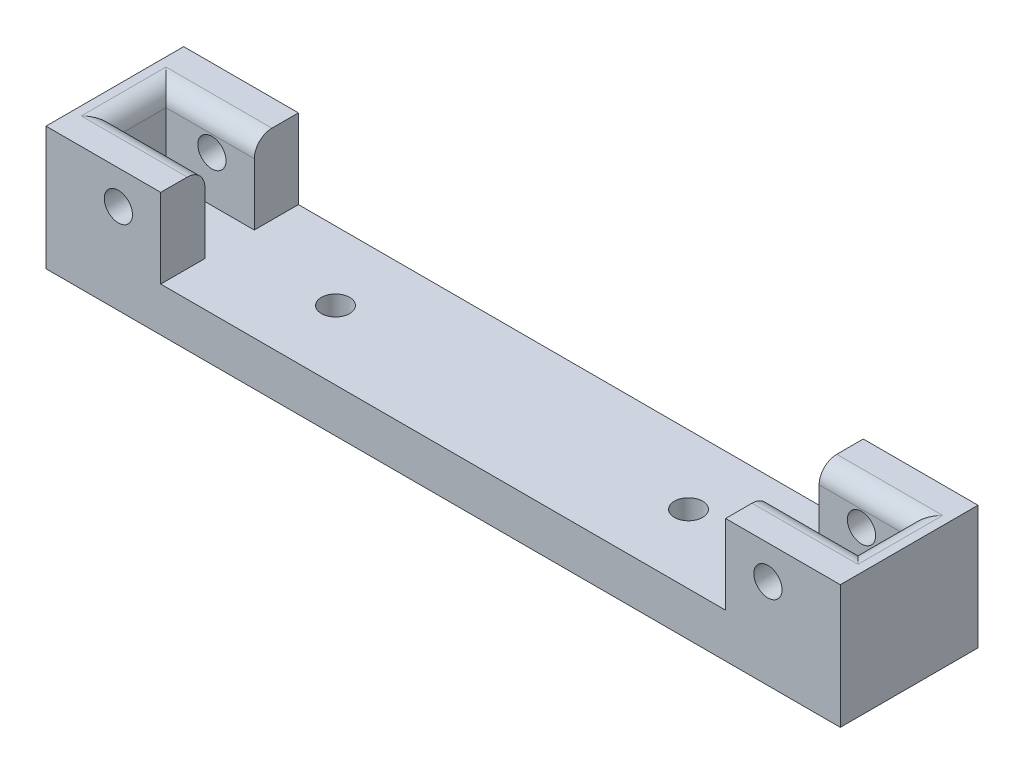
ISO-10303-21;
HEADER;
FILE_DESCRIPTION(('STEP AP214'),'2;1');
FILE_NAME('part.step','',(''),(''),'','','');
FILE_SCHEMA(('AUTOMOTIVE_DESIGN { 1 0 10303 214 1 1 1 1 }'));
ENDSEC;
DATA;
#1=APPLICATION_CONTEXT('core data for automotive mechanical design processes');
#2=APPLICATION_PROTOCOL_DEFINITION('international standard','automotive_design',2000,#1);
#3=PRODUCT_CONTEXT('',#1,'mechanical');
#4=PRODUCT('Part','Part','',(#3));
#5=PRODUCT_RELATED_PRODUCT_CATEGORY('part','',(#4));
#6=PRODUCT_DEFINITION_FORMATION('','',#4);
#7=PRODUCT_DEFINITION_CONTEXT('part definition',#1,'design');
#8=PRODUCT_DEFINITION('design','',#6,#7);
#9=PRODUCT_DEFINITION_SHAPE('','',#8);
#10=(LENGTH_UNIT() NAMED_UNIT(*) SI_UNIT(.MILLI.,.METRE.));
#11=(NAMED_UNIT(*) PLANE_ANGLE_UNIT() SI_UNIT($,.RADIAN.));
#12=(NAMED_UNIT(*) SI_UNIT($,.STERADIAN.) SOLID_ANGLE_UNIT());
#13=UNCERTAINTY_MEASURE_WITH_UNIT(LENGTH_MEASURE(1.E-05),#10,'distance_accuracy_value','');
#14=(GEOMETRIC_REPRESENTATION_CONTEXT(3) GLOBAL_UNCERTAINTY_ASSIGNED_CONTEXT((#13)) GLOBAL_UNIT_ASSIGNED_CONTEXT((#10,
#11,#12)) REPRESENTATION_CONTEXT('',''));
#15=CARTESIAN_POINT('',(0.,0.,0.));
#16=DIRECTION('',(0.,0.,1.));
#17=DIRECTION('',(1.,0.,0.));
#18=AXIS2_PLACEMENT_3D('',#15,#16,#17);
#19=CARTESIAN_POINT('',(0.,6.35,0.));
#20=DIRECTION('',(0.,-1.,0.));
#21=DIRECTION('',(0.,0.,-1.));
#22=AXIS2_PLACEMENT_3D('',#19,#20,#21);
#23=PLANE('',#22);
#24=CARTESIAN_POINT('',(82.55,6.35,-9.906));
#25=DIRECTION('',(0.,-1.,0.));
#26=DIRECTION('',(0.,0.,1.));
#27=AXIS2_PLACEMENT_3D('',#24,#25,#26);
#28=CIRCLE('',#27,2.032);
#29=CARTESIAN_POINT('',(82.55,6.35,-7.874));
#30=VERTEX_POINT('',#29);
#31=EDGE_CURVE('E395',#30,#30,#28,.T.);
#32=ORIENTED_EDGE('',*,*,#31,.T.);
#33=EDGE_LOOP('',(#32));
#34=FACE_BOUND('',#33,.T.);
#35=CARTESIAN_POINT('',(31.75,6.35,-9.906));
#36=DIRECTION('',(0.,1.,0.));
#37=DIRECTION('',(0.,0.,1.));
#38=AXIS2_PLACEMENT_3D('',#35,#36,#37);
#39=CIRCLE('',#38,2.032);
#40=CARTESIAN_POINT('',(31.75,6.35,-7.874));
#41=VERTEX_POINT('',#40);
#42=EDGE_CURVE('E388',#41,#41,#39,.T.);
#43=ORIENTED_EDGE('',*,*,#42,.F.);
#44=EDGE_LOOP('',(#43));
#45=FACE_BOUND('',#44,.T.);
#46=DIRECTION('',(-1.,0.,0.));
#47=VECTOR('',#46,1.);
#48=CARTESIAN_POINT('',(110.49,6.35,-13.462));
#49=LINE('',#48,#47);
#50=CARTESIAN_POINT('',(110.49,6.35,-13.462));
#51=VERTEX_POINT('',#50);
#52=CARTESIAN_POINT('',(97.79,6.35,-13.462));
#53=VERTEX_POINT('',#52);
#54=EDGE_CURVE('E182',#51,#53,#49,.T.);
#55=ORIENTED_EDGE('',*,*,#54,.T.);
#56=DIRECTION('',(0.,0.,-1.));
#57=VECTOR('',#56,1.);
#58=CARTESIAN_POINT('',(97.79,6.35,-19.812));
#59=LINE('',#58,#57);
#60=CARTESIAN_POINT('',(97.79,6.35,-19.812));
#61=VERTEX_POINT('',#60);
#62=EDGE_CURVE('E405',#53,#61,#59,.T.);
#63=ORIENTED_EDGE('',*,*,#62,.T.);
#64=DIRECTION('',(-1.,0.,0.));
#65=VECTOR('',#64,1.);
#66=CARTESIAN_POINT('',(0.,6.35,-19.812));
#67=LINE('',#66,#65);
#68=CARTESIAN_POINT('',(16.51,6.35,-19.812));
#69=VERTEX_POINT('',#68);
#70=EDGE_CURVE('E200',#61,#69,#67,.T.);
#71=ORIENTED_EDGE('',*,*,#70,.T.);
#72=DIRECTION('',(0.,0.,-1.));
#73=VECTOR('',#72,1.);
#74=CARTESIAN_POINT('',(16.51,6.35,-19.812));
#75=LINE('',#74,#73);
#76=CARTESIAN_POINT('',(16.51,6.35,-13.462));
#77=VERTEX_POINT('',#76);
#78=EDGE_CURVE('E241',#77,#69,#75,.T.);
#79=ORIENTED_EDGE('',*,*,#78,.F.);
#80=DIRECTION('',(1.,0.,0.));
#81=VECTOR('',#80,1.);
#82=CARTESIAN_POINT('',(3.81,6.35,-13.462));
#83=LINE('',#82,#81);
#84=CARTESIAN_POINT('',(3.81,6.35,-13.462));
#85=VERTEX_POINT('',#84);
#86=EDGE_CURVE('E237',#85,#77,#83,.T.);
#87=ORIENTED_EDGE('',*,*,#86,.F.);
#88=DIRECTION('',(0.,0.,-1.));
#89=VECTOR('',#88,1.);
#90=CARTESIAN_POINT('',(3.81,6.35,-19.812));
#91=LINE('',#90,#89);
#92=CARTESIAN_POINT('',(3.81,6.35,-6.35));
#93=VERTEX_POINT('',#92);
#94=EDGE_CURVE('E266',#93,#85,#91,.T.);
#95=ORIENTED_EDGE('',*,*,#94,.F.);
#96=DIRECTION('',(-1.,0.,0.));
#97=VECTOR('',#96,1.);
#98=CARTESIAN_POINT('',(3.81,6.35,-6.35));
#99=LINE('',#98,#97);
#100=CARTESIAN_POINT('',(16.51,6.35,-6.35));
#101=VERTEX_POINT('',#100);
#102=EDGE_CURVE('E256',#101,#93,#99,.T.);
#103=ORIENTED_EDGE('',*,*,#102,.F.);
#104=DIRECTION('',(0.,0.,-1.));
#105=VECTOR('',#104,1.);
#106=CARTESIAN_POINT('',(16.51,6.35,0.));
#107=LINE('',#106,#105);
#108=CARTESIAN_POINT('',(16.51,6.35,0.));
#109=VERTEX_POINT('',#108);
#110=EDGE_CURVE('E251',#109,#101,#107,.T.);
#111=ORIENTED_EDGE('',*,*,#110,.F.);
#112=DIRECTION('',(1.,0.,0.));
#113=VECTOR('',#112,1.);
#114=CARTESIAN_POINT('',(0.,6.35,0.));
#115=LINE('',#114,#113);
#116=CARTESIAN_POINT('',(97.79,6.35,0.));
#117=VERTEX_POINT('',#116);
#118=EDGE_CURVE('E286',#109,#117,#115,.T.);
#119=ORIENTED_EDGE('',*,*,#118,.T.);
#120=DIRECTION('',(0.,0.,-1.));
#121=VECTOR('',#120,1.);
#122=CARTESIAN_POINT('',(97.79,6.35,0.));
#123=LINE('',#122,#121);
#124=CARTESIAN_POINT('',(97.79,6.35,-6.35));
#125=VERTEX_POINT('',#124);
#126=EDGE_CURVE('E205',#117,#125,#123,.T.);
#127=ORIENTED_EDGE('',*,*,#126,.T.);
#128=DIRECTION('',(1.,0.,0.));
#129=VECTOR('',#128,1.);
#130=CARTESIAN_POINT('',(110.49,6.35,-6.35));
#131=LINE('',#130,#129);
#132=CARTESIAN_POINT('',(110.49,6.35,-6.35));
#133=VERTEX_POINT('',#132);
#134=EDGE_CURVE('E201',#125,#133,#131,.T.);
#135=ORIENTED_EDGE('',*,*,#134,.T.);
#136=DIRECTION('',(0.,0.,-1.));
#137=VECTOR('',#136,1.);
#138=CARTESIAN_POINT('',(110.49,6.35,-19.812));
#139=LINE('',#138,#137);
#140=EDGE_CURVE('E194',#133,#51,#139,.T.);
#141=ORIENTED_EDGE('',*,*,#140,.T.);
#142=EDGE_LOOP('',(#55,#63,#71,#79,#87,#95,#103,#111,#119,#127,#135,#141));
#143=FACE_BOUND('',#142,.T.);
#144=ADVANCED_FACE('F36',(#34,#45,#143),#23,.F.);
#145=CARTESIAN_POINT('',(3.81,17.78,-19.812));
#146=DIRECTION('',(-1.,0.,0.));
#147=DIRECTION('',(0.,0.,1.));
#148=AXIS2_PLACEMENT_3D('',#145,#146,#147);
#149=PLANE('',#148);
#150=DIRECTION('',(0.,-1.,0.));
#151=VECTOR('',#150,1.);
#152=CARTESIAN_POINT('',(3.81,17.78,-13.462));
#153=LINE('',#152,#151);
#154=CARTESIAN_POINT('',(3.81,15.24,-13.462));
#155=VERTEX_POINT('',#154);
#156=EDGE_CURVE('E249',#155,#85,#153,.T.);
#157=ORIENTED_EDGE('',*,*,#156,.F.);
#158=DIRECTION('',(0.,0.,-1.));
#159=VECTOR('',#158,1.);
#160=CARTESIAN_POINT('',(3.81,15.24,-19.812));
#161=LINE('',#160,#159);
#162=CARTESIAN_POINT('',(3.81,15.24,-6.35));
#163=VERTEX_POINT('',#162);
#164=EDGE_CURVE('E306',#155,#163,#161,.F.);
#165=ORIENTED_EDGE('',*,*,#164,.T.);
#166=DIRECTION('',(0.,-1.,0.));
#167=VECTOR('',#166,1.);
#168=CARTESIAN_POINT('',(3.81,17.78,-6.35));
#169=LINE('',#168,#167);
#170=EDGE_CURVE('E255',#163,#93,#169,.T.);
#171=ORIENTED_EDGE('',*,*,#170,.T.);
#172=ORIENTED_EDGE('',*,*,#94,.T.);
#173=EDGE_LOOP('',(#157,#165,#171,#172));
#174=FACE_BOUND('',#173,.T.);
#175=ADVANCED_FACE('F360',(#174),#149,.F.);
#176=CARTESIAN_POINT('',(0.,6.35,0.));
#177=DIRECTION('',(1.,0.,0.));
#178=DIRECTION('',(0.,0.,-1.));
#179=AXIS2_PLACEMENT_3D('',#176,#177,#178);
#180=PLANE('',#179);
#181=DIRECTION('',(0.,0.,1.));
#182=VECTOR('',#181,1.);
#183=CARTESIAN_POINT('',(0.,0.,0.));
#184=LINE('',#183,#182);
#185=CARTESIAN_POINT('',(0.,0.,-19.812));
#186=VERTEX_POINT('',#185);
#187=CARTESIAN_POINT('',(0.,0.,0.));
#188=VERTEX_POINT('',#187);
#189=EDGE_CURVE('E275',#186,#188,#184,.T.);
#190=ORIENTED_EDGE('',*,*,#189,.T.);
#191=DIRECTION('',(0.,-1.,0.));
#192=VECTOR('',#191,1.);
#193=CARTESIAN_POINT('',(0.,6.35,0.));
#194=LINE('',#193,#192);
#195=CARTESIAN_POINT('',(0.,17.78,0.));
#196=VERTEX_POINT('',#195);
#197=EDGE_CURVE('E284',#196,#188,#194,.T.);
#198=ORIENTED_EDGE('',*,*,#197,.F.);
#199=DIRECTION('',(0.,0.,1.));
#200=VECTOR('',#199,1.);
#201=CARTESIAN_POINT('',(0.,17.78,-19.812));
#202=LINE('',#201,#200);
#203=CARTESIAN_POINT('',(0.,17.78,-19.812));
#204=VERTEX_POINT('',#203);
#205=EDGE_CURVE('E270',#204,#196,#202,.T.);
#206=ORIENTED_EDGE('',*,*,#205,.F.);
#207=DIRECTION('',(0.,-1.,0.));
#208=VECTOR('',#207,1.);
#209=CARTESIAN_POINT('',(0.,6.35,-19.812));
#210=LINE('',#209,#208);
#211=EDGE_CURVE('E315',#204,#186,#210,.T.);
#212=ORIENTED_EDGE('',*,*,#211,.T.);
#213=EDGE_LOOP('',(#190,#198,#206,#212));
#214=FACE_BOUND('',#213,.T.);
#215=ADVANCED_FACE('F346',(#214),#180,.F.);
#216=CARTESIAN_POINT('',(0.,6.35,0.));
#217=DIRECTION('',(0.,0.,-1.));
#218=DIRECTION('',(-1.,0.,0.));
#219=AXIS2_PLACEMENT_3D('',#216,#217,#218);
#220=PLANE('',#219);
#221=CARTESIAN_POINT('',(103.886,12.954,0.));
#222=DIRECTION('',(0.,0.,-1.));
#223=DIRECTION('',(-1.,0.,0.));
#224=AXIS2_PLACEMENT_3D('',#221,#222,#223);
#225=CIRCLE('',#224,2.032);
#226=CARTESIAN_POINT('',(101.854,12.954,0.));
#227=VERTEX_POINT('',#226);
#228=EDGE_CURVE('E391',#227,#227,#225,.T.);
#229=ORIENTED_EDGE('',*,*,#228,.T.);
#230=EDGE_LOOP('',(#229));
#231=FACE_BOUND('',#230,.T.);
#232=DIRECTION('',(0.,-1.,0.));
#233=VECTOR('',#232,1.);
#234=CARTESIAN_POINT('',(97.79,17.78,0.));
#235=LINE('',#234,#233);
#236=CARTESIAN_POINT('',(97.79,17.78,0.));
#237=VERTEX_POINT('',#236);
#238=EDGE_CURVE('E212',#237,#117,#235,.T.);
#239=ORIENTED_EDGE('',*,*,#238,.T.);
#240=ORIENTED_EDGE('',*,*,#118,.F.);
#241=DIRECTION('',(0.,-1.,0.));
#242=VECTOR('',#241,1.);
#243=CARTESIAN_POINT('',(16.51,17.78,0.));
#244=LINE('',#243,#242);
#245=CARTESIAN_POINT('',(16.51,17.78,0.));
#246=VERTEX_POINT('',#245);
#247=EDGE_CURVE('E264',#246,#109,#244,.T.);
#248=ORIENTED_EDGE('',*,*,#247,.F.);
#249=DIRECTION('',(1.,0.,0.));
#250=VECTOR('',#249,1.);
#251=CARTESIAN_POINT('',(0.,17.78,0.));
#252=LINE('',#251,#250);
#253=EDGE_CURVE('E273',#196,#246,#252,.T.);
#254=ORIENTED_EDGE('',*,*,#253,.F.);
#255=ORIENTED_EDGE('',*,*,#197,.T.);
#256=DIRECTION('',(1.,0.,0.));
#257=VECTOR('',#256,1.);
#258=CARTESIAN_POINT('',(0.,0.,0.));
#259=LINE('',#258,#257);
#260=CARTESIAN_POINT('',(114.3,0.,0.));
#261=VERTEX_POINT('',#260);
#262=EDGE_CURVE('E322',#188,#261,#259,.T.);
#263=ORIENTED_EDGE('',*,*,#262,.T.);
#264=DIRECTION('',(0.,-1.,0.));
#265=VECTOR('',#264,1.);
#266=CARTESIAN_POINT('',(114.3,6.35,0.));
#267=LINE('',#266,#265);
#268=CARTESIAN_POINT('',(114.3,17.78,0.));
#269=VERTEX_POINT('',#268);
#270=EDGE_CURVE('E330',#269,#261,#267,.T.);
#271=ORIENTED_EDGE('',*,*,#270,.F.);
#272=DIRECTION('',(-1.,0.,0.));
#273=VECTOR('',#272,1.);
#274=CARTESIAN_POINT('',(114.3,17.78,0.));
#275=LINE('',#274,#273);
#276=EDGE_CURVE('E193',#269,#237,#275,.T.);
#277=ORIENTED_EDGE('',*,*,#276,.T.);
#278=EDGE_LOOP('',(#239,#240,#248,#254,#255,#263,#271,#277));
#279=FACE_BOUND('',#278,.T.);
#280=CARTESIAN_POINT('',(10.414,12.954,0.));
#281=DIRECTION('',(0.,0.,1.));
#282=DIRECTION('',(1.,0.,0.));
#283=AXIS2_PLACEMENT_3D('',#280,#281,#282);
#284=CIRCLE('',#283,2.032);
#285=CARTESIAN_POINT('',(12.446,12.954,0.));
#286=VERTEX_POINT('',#285);
#287=EDGE_CURVE('E231',#286,#286,#284,.T.);
#288=ORIENTED_EDGE('',*,*,#287,.F.);
#289=EDGE_LOOP('',(#288));
#290=FACE_BOUND('',#289,.T.);
#291=ADVANCED_FACE('F337',(#231,#279,#290),#220,.F.);
#292=CARTESIAN_POINT('',(114.3,6.35,0.));
#293=DIRECTION('',(-1.,0.,0.));
#294=DIRECTION('',(0.,0.,1.));
#295=AXIS2_PLACEMENT_3D('',#292,#293,#294);
#296=PLANE('',#295);
#297=DIRECTION('',(0.,0.,-1.));
#298=VECTOR('',#297,1.);
#299=CARTESIAN_POINT('',(114.3,0.,0.));
#300=LINE('',#299,#298);
#301=CARTESIAN_POINT('',(114.3,0.,-19.812));
#302=VERTEX_POINT('',#301);
#303=EDGE_CURVE('E324',#261,#302,#300,.T.);
#304=ORIENTED_EDGE('',*,*,#303,.T.);
#305=DIRECTION('',(0.,-1.,0.));
#306=VECTOR('',#305,1.);
#307=CARTESIAN_POINT('',(114.3,6.35,-19.812));
#308=LINE('',#307,#306);
#309=CARTESIAN_POINT('',(114.3,17.78,-19.812));
#310=VERTEX_POINT('',#309);
#311=EDGE_CURVE('E329',#310,#302,#308,.T.);
#312=ORIENTED_EDGE('',*,*,#311,.F.);
#313=DIRECTION('',(0.,0.,1.));
#314=VECTOR('',#313,1.);
#315=CARTESIAN_POINT('',(114.3,17.78,-19.812));
#316=LINE('',#315,#314);
#317=EDGE_CURVE('E190',#310,#269,#316,.T.);
#318=ORIENTED_EDGE('',*,*,#317,.T.);
#319=ORIENTED_EDGE('',*,*,#270,.T.);
#320=EDGE_LOOP('',(#304,#312,#318,#319));
#321=FACE_BOUND('',#320,.T.);
#322=ADVANCED_FACE('F348',(#321),#296,.F.);
#323=CARTESIAN_POINT('',(0.,6.35,-19.812));
#324=DIRECTION('',(0.,0.,1.));
#325=DIRECTION('',(1.,0.,0.));
#326=AXIS2_PLACEMENT_3D('',#323,#324,#325);
#327=PLANE('',#326);
#328=CARTESIAN_POINT('',(103.886,12.954,-19.812));
#329=DIRECTION('',(0.,0.,-1.));
#330=DIRECTION('',(-1.,0.,0.));
#331=AXIS2_PLACEMENT_3D('',#328,#329,#330);
#332=CIRCLE('',#331,2.032);
#333=CARTESIAN_POINT('',(101.854,12.954,-19.812));
#334=VERTEX_POINT('',#333);
#335=EDGE_CURVE('E398',#334,#334,#332,.T.);
#336=ORIENTED_EDGE('',*,*,#335,.F.);
#337=EDGE_LOOP('',(#336));
#338=FACE_BOUND('',#337,.T.);
#339=ORIENTED_EDGE('',*,*,#70,.F.);
#340=DIRECTION('',(0.,-1.,0.));
#341=VECTOR('',#340,1.);
#342=CARTESIAN_POINT('',(97.79,17.78,-19.812));
#343=LINE('',#342,#341);
#344=CARTESIAN_POINT('',(97.79,17.78,-19.812));
#345=VERTEX_POINT('',#344);
#346=EDGE_CURVE('E179',#345,#61,#343,.T.);
#347=ORIENTED_EDGE('',*,*,#346,.F.);
#348=DIRECTION('',(1.,0.,0.));
#349=VECTOR('',#348,1.);
#350=CARTESIAN_POINT('',(114.3,17.78,-19.812));
#351=LINE('',#350,#349);
#352=EDGE_CURVE('E186',#345,#310,#351,.T.);
#353=ORIENTED_EDGE('',*,*,#352,.T.);
#354=ORIENTED_EDGE('',*,*,#311,.T.);
#355=DIRECTION('',(-1.,0.,0.));
#356=VECTOR('',#355,1.);
#357=CARTESIAN_POINT('',(0.,0.,-19.812));
#358=LINE('',#357,#356);
#359=EDGE_CURVE('E288',#302,#186,#358,.T.);
#360=ORIENTED_EDGE('',*,*,#359,.T.);
#361=ORIENTED_EDGE('',*,*,#211,.F.);
#362=DIRECTION('',(-1.,0.,0.));
#363=VECTOR('',#362,1.);
#364=CARTESIAN_POINT('',(0.,17.78,-19.812));
#365=LINE('',#364,#363);
#366=CARTESIAN_POINT('',(16.51,17.78,-19.812));
#367=VERTEX_POINT('',#366);
#368=EDGE_CURVE('E267',#367,#204,#365,.T.);
#369=ORIENTED_EDGE('',*,*,#368,.F.);
#370=DIRECTION('',(0.,-1.,0.));
#371=VECTOR('',#370,1.);
#372=CARTESIAN_POINT('',(16.51,17.78,-19.812));
#373=LINE('',#372,#371);
#374=EDGE_CURVE('E240',#367,#69,#373,.T.);
#375=ORIENTED_EDGE('',*,*,#374,.T.);
#376=EDGE_LOOP('',(#339,#347,#353,#354,#360,#361,#369,#375));
#377=FACE_BOUND('',#376,.T.);
#378=CARTESIAN_POINT('',(10.414,12.954,-19.812));
#379=DIRECTION('',(0.,0.,1.));
#380=DIRECTION('',(1.,0.,0.));
#381=AXIS2_PLACEMENT_3D('',#378,#379,#380);
#382=CIRCLE('',#381,2.032);
#383=CARTESIAN_POINT('',(12.446,12.954,-19.812));
#384=VERTEX_POINT('',#383);
#385=EDGE_CURVE('E227',#384,#384,#382,.T.);
#386=ORIENTED_EDGE('',*,*,#385,.T.);
#387=EDGE_LOOP('',(#386));
#388=FACE_BOUND('',#387,.T.);
#389=ADVANCED_FACE('F197',(#338,#377,#388),#327,.F.);
#390=CARTESIAN_POINT('',(0.,0.,0.));
#391=DIRECTION('',(0.,-1.,0.));
#392=DIRECTION('',(0.,0.,-1.));
#393=AXIS2_PLACEMENT_3D('',#390,#391,#392);
#394=PLANE('',#393);
#395=CARTESIAN_POINT('',(82.55,0.,-9.906));
#396=DIRECTION('',(0.,-1.,0.));
#397=DIRECTION('',(0.,0.,1.));
#398=AXIS2_PLACEMENT_3D('',#395,#396,#397);
#399=CIRCLE('',#398,2.032);
#400=CARTESIAN_POINT('',(82.55,0.,-7.874));
#401=VERTEX_POINT('',#400);
#402=EDGE_CURVE('E383',#401,#401,#399,.T.);
#403=ORIENTED_EDGE('',*,*,#402,.F.);
#404=EDGE_LOOP('',(#403));
#405=FACE_BOUND('',#404,.T.);
#406=CARTESIAN_POINT('',(31.75,0.,-9.906));
#407=DIRECTION('',(0.,1.,0.));
#408=DIRECTION('',(0.,0.,1.));
#409=AXIS2_PLACEMENT_3D('',#406,#407,#408);
#410=CIRCLE('',#409,2.032);
#411=CARTESIAN_POINT('',(31.75,0.,-7.874));
#412=VERTEX_POINT('',#411);
#413=EDGE_CURVE('E386',#412,#412,#410,.T.);
#414=ORIENTED_EDGE('',*,*,#413,.T.);
#415=EDGE_LOOP('',(#414));
#416=FACE_BOUND('',#415,.T.);
#417=ORIENTED_EDGE('',*,*,#189,.F.);
#418=ORIENTED_EDGE('',*,*,#359,.F.);
#419=ORIENTED_EDGE('',*,*,#303,.F.);
#420=ORIENTED_EDGE('',*,*,#262,.F.);
#421=EDGE_LOOP('',(#417,#418,#419,#420));
#422=FACE_BOUND('',#421,.T.);
#423=ADVANCED_FACE('F344',(#405,#416,#422),#394,.T.);
#424=CARTESIAN_POINT('',(0.,17.78,0.));
#425=DIRECTION('',(0.,-1.,0.));
#426=DIRECTION('',(0.,0.,-1.));
#427=AXIS2_PLACEMENT_3D('',#424,#425,#426);
#428=PLANE('',#427);
#429=DIRECTION('',(0.,0.,-1.));
#430=VECTOR('',#429,1.);
#431=CARTESIAN_POINT('',(1.27,17.78,0.));
#432=LINE('',#431,#430);
#433=CARTESIAN_POINT('',(1.27,17.78,-3.81));
#434=VERTEX_POINT('',#433);
#435=CARTESIAN_POINT('',(1.27,17.78,-16.002));
#436=VERTEX_POINT('',#435);
#437=EDGE_CURVE('E297',#434,#436,#432,.T.);
#438=ORIENTED_EDGE('',*,*,#437,.T.);
#439=DIRECTION('',(1.,0.,0.));
#440=VECTOR('',#439,1.);
#441=CARTESIAN_POINT('',(0.,17.78,-16.002));
#442=LINE('',#441,#440);
#443=CARTESIAN_POINT('',(16.51,17.78,-16.002));
#444=VERTEX_POINT('',#443);
#445=EDGE_CURVE('E299',#436,#444,#442,.T.);
#446=ORIENTED_EDGE('',*,*,#445,.T.);
#447=DIRECTION('',(0.,0.,-1.));
#448=VECTOR('',#447,1.);
#449=CARTESIAN_POINT('',(16.51,17.78,-19.812));
#450=LINE('',#449,#448);
#451=EDGE_CURVE('E238',#444,#367,#450,.T.);
#452=ORIENTED_EDGE('',*,*,#451,.T.);
#453=ORIENTED_EDGE('',*,*,#368,.T.);
#454=ORIENTED_EDGE('',*,*,#205,.T.);
#455=ORIENTED_EDGE('',*,*,#253,.T.);
#456=DIRECTION('',(0.,0.,-1.));
#457=VECTOR('',#456,1.);
#458=CARTESIAN_POINT('',(16.51,17.78,0.));
#459=LINE('',#458,#457);
#460=CARTESIAN_POINT('',(16.51,17.78,-3.81));
#461=VERTEX_POINT('',#460);
#462=EDGE_CURVE('E252',#246,#461,#459,.T.);
#463=ORIENTED_EDGE('',*,*,#462,.T.);
#464=DIRECTION('',(-1.,0.,0.));
#465=VECTOR('',#464,1.);
#466=CARTESIAN_POINT('',(0.,17.78,-3.81));
#467=LINE('',#466,#465);
#468=EDGE_CURVE('E291',#461,#434,#467,.T.);
#469=ORIENTED_EDGE('',*,*,#468,.T.);
#470=EDGE_LOOP('',(#438,#446,#452,#453,#454,#455,#463,#469));
#471=FACE_BOUND('',#470,.T.);
#472=ADVANCED_FACE('F373',(#471),#428,.F.);
#473=CARTESIAN_POINT('',(16.51,17.78,0.));
#474=DIRECTION('',(-1.,0.,0.));
#475=DIRECTION('',(0.,0.,1.));
#476=AXIS2_PLACEMENT_3D('',#473,#474,#475);
#477=PLANE('',#476);
#478=DIRECTION('',(0.,-1.,0.));
#479=VECTOR('',#478,1.);
#480=CARTESIAN_POINT('',(16.51,17.78,-6.35));
#481=LINE('',#480,#479);
#482=CARTESIAN_POINT('',(16.51,15.24,-6.35));
#483=VERTEX_POINT('',#482);
#484=EDGE_CURVE('E262',#483,#101,#481,.T.);
#485=ORIENTED_EDGE('',*,*,#484,.F.);
#486=CARTESIAN_POINT('',(16.51,15.24,-3.81));
#487=DIRECTION('',(-1.,0.,0.));
#488=DIRECTION('',(0.,0.,1.));
#489=AXIS2_PLACEMENT_3D('',#486,#487,#488);
#490=CIRCLE('',#489,2.54);
#491=EDGE_CURVE('E295',#483,#461,#490,.F.);
#492=ORIENTED_EDGE('',*,*,#491,.T.);
#493=ORIENTED_EDGE('',*,*,#462,.F.);
#494=ORIENTED_EDGE('',*,*,#247,.T.);
#495=ORIENTED_EDGE('',*,*,#110,.T.);
#496=EDGE_LOOP('',(#485,#492,#493,#494,#495));
#497=FACE_BOUND('',#496,.T.);
#498=ADVANCED_FACE('F378',(#497),#477,.F.);
#499=CARTESIAN_POINT('',(3.81,17.78,-6.35));
#500=DIRECTION('',(0.,0.,1.));
#501=DIRECTION('',(1.,0.,0.));
#502=AXIS2_PLACEMENT_3D('',#499,#500,#501);
#503=PLANE('',#502);
#504=CARTESIAN_POINT('',(10.414,12.954,-6.35));
#505=DIRECTION('',(0.,0.,1.));
#506=DIRECTION('',(1.,0.,0.));
#507=AXIS2_PLACEMENT_3D('',#504,#505,#506);
#508=CIRCLE('',#507,2.032);
#509=CARTESIAN_POINT('',(12.446,12.954,-6.35));
#510=VERTEX_POINT('',#509);
#511=EDGE_CURVE('E234',#510,#510,#508,.T.);
#512=ORIENTED_EDGE('',*,*,#511,.T.);
#513=EDGE_LOOP('',(#512));
#514=FACE_BOUND('',#513,.T.);
#515=ORIENTED_EDGE('',*,*,#170,.F.);
#516=DIRECTION('',(-1.,0.,0.));
#517=VECTOR('',#516,1.);
#518=CARTESIAN_POINT('',(3.81,15.24,-6.35));
#519=LINE('',#518,#517);
#520=EDGE_CURVE('E293',#163,#483,#519,.F.);
#521=ORIENTED_EDGE('',*,*,#520,.T.);
#522=ORIENTED_EDGE('',*,*,#484,.T.);
#523=ORIENTED_EDGE('',*,*,#102,.T.);
#524=EDGE_LOOP('',(#515,#521,#522,#523));
#525=FACE_BOUND('',#524,.T.);
#526=ADVANCED_FACE('F447',(#514,#525),#503,.F.);
#527=CARTESIAN_POINT('',(3.81,17.78,-13.462));
#528=DIRECTION('',(0.,0.,-1.));
#529=DIRECTION('',(-1.,0.,0.));
#530=AXIS2_PLACEMENT_3D('',#527,#528,#529);
#531=PLANE('',#530);
#532=CARTESIAN_POINT('',(10.414,12.954,-13.462));
#533=DIRECTION('',(0.,0.,-1.));
#534=DIRECTION('',(-1.,0.,0.));
#535=AXIS2_PLACEMENT_3D('',#532,#533,#534);
#536=CIRCLE('',#535,2.032);
#537=CARTESIAN_POINT('',(8.382,12.954,-13.462));
#538=VERTEX_POINT('',#537);
#539=EDGE_CURVE('E230',#538,#538,#536,.T.);
#540=ORIENTED_EDGE('',*,*,#539,.T.);
#541=EDGE_LOOP('',(#540));
#542=FACE_BOUND('',#541,.T.);
#543=DIRECTION('',(0.,-1.,0.));
#544=VECTOR('',#543,1.);
#545=CARTESIAN_POINT('',(16.51,17.78,-13.462));
#546=LINE('',#545,#544);
#547=CARTESIAN_POINT('',(16.51,15.24,-13.462));
#548=VERTEX_POINT('',#547);
#549=EDGE_CURVE('E247',#548,#77,#546,.T.);
#550=ORIENTED_EDGE('',*,*,#549,.F.);
#551=DIRECTION('',(1.,0.,0.));
#552=VECTOR('',#551,1.);
#553=CARTESIAN_POINT('',(3.81,15.24,-13.462));
#554=LINE('',#553,#552);
#555=EDGE_CURVE('E304',#548,#155,#554,.F.);
#556=ORIENTED_EDGE('',*,*,#555,.T.);
#557=ORIENTED_EDGE('',*,*,#156,.T.);
#558=ORIENTED_EDGE('',*,*,#86,.T.);
#559=EDGE_LOOP('',(#550,#556,#557,#558));
#560=FACE_BOUND('',#559,.T.);
#561=ADVANCED_FACE('F435',(#542,#560),#531,.F.);
#562=CARTESIAN_POINT('',(16.51,17.78,-19.812));
#563=DIRECTION('',(-1.,0.,0.));
#564=DIRECTION('',(0.,0.,1.));
#565=AXIS2_PLACEMENT_3D('',#562,#563,#564);
#566=PLANE('',#565);
#567=ORIENTED_EDGE('',*,*,#451,.F.);
#568=CARTESIAN_POINT('',(16.51,15.24,-16.002));
#569=DIRECTION('',(-1.,0.,0.));
#570=DIRECTION('',(0.,0.,1.));
#571=AXIS2_PLACEMENT_3D('',#568,#569,#570);
#572=CIRCLE('',#571,2.54);
#573=EDGE_CURVE('E302',#444,#548,#572,.F.);
#574=ORIENTED_EDGE('',*,*,#573,.T.);
#575=ORIENTED_EDGE('',*,*,#549,.T.);
#576=ORIENTED_EDGE('',*,*,#78,.T.);
#577=ORIENTED_EDGE('',*,*,#374,.F.);
#578=EDGE_LOOP('',(#567,#574,#575,#576,#577));
#579=FACE_BOUND('',#578,.T.);
#580=ADVANCED_FACE('F429',(#579),#566,.F.);
#581=CARTESIAN_POINT('',(10.414,12.954,-19.812));
#582=DIRECTION('',(0.,0.,1.));
#583=DIRECTION('',(1.,0.,0.));
#584=AXIS2_PLACEMENT_3D('',#581,#582,#583);
#585=CYLINDRICAL_SURFACE('',#584,2.032);
#586=ORIENTED_EDGE('',*,*,#385,.F.);
#587=EDGE_LOOP('',(#586));
#588=FACE_BOUND('',#587,.T.);
#589=ORIENTED_EDGE('',*,*,#539,.F.);
#590=EDGE_LOOP('',(#589));
#591=FACE_BOUND('',#590,.T.);
#592=ADVANCED_FACE('F644',(#588,#591),#585,.F.);
#593=ORIENTED_EDGE('',*,*,#287,.T.);
#594=EDGE_LOOP('',(#593));
#595=FACE_BOUND('',#594,.T.);
#596=ORIENTED_EDGE('',*,*,#511,.F.);
#597=EDGE_LOOP('',(#596));
#598=FACE_BOUND('',#597,.T.);
#599=ADVANCED_FACE('F501',(#595,#598),#585,.F.);
#600=CARTESIAN_POINT('',(0.,15.24,-3.81));
#601=DIRECTION('',(-1.,0.,0.));
#602=DIRECTION('',(0.,0.,1.));
#603=AXIS2_PLACEMENT_3D('',#600,#601,#602);
#604=CYLINDRICAL_SURFACE('',#603,2.54);
#605=ORIENTED_EDGE('',*,*,#491,.F.);
#606=ORIENTED_EDGE('',*,*,#520,.F.);
#607=CARTESIAN_POINT('',(1.27,15.24,-3.81));
#608=DIRECTION('',(-0.707106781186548,0.,-0.707106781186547));
#609=DIRECTION('',(0.707106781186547,0.,-0.707106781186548));
#610=AXIS2_PLACEMENT_3D('',#607,#608,#609);
#611=ELLIPSE('',#610,3.59210244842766,2.54);
#612=EDGE_CURVE('E308',#163,#434,#611,.F.);
#613=ORIENTED_EDGE('',*,*,#612,.T.);
#614=ORIENTED_EDGE('',*,*,#468,.F.);
#615=EDGE_LOOP('',(#605,#606,#613,#614));
#616=FACE_BOUND('',#615,.T.);
#617=ADVANCED_FACE('F453',(#616),#604,.T.);
#618=CARTESIAN_POINT('',(1.27,15.24,0.));
#619=DIRECTION('',(0.,0.,-1.));
#620=DIRECTION('',(-1.,0.,0.));
#621=AXIS2_PLACEMENT_3D('',#618,#619,#620);
#622=CYLINDRICAL_SURFACE('',#621,2.54);
#623=ORIENTED_EDGE('',*,*,#612,.F.);
#624=ORIENTED_EDGE('',*,*,#164,.F.);
#625=CARTESIAN_POINT('',(1.27,15.24,-16.002));
#626=DIRECTION('',(0.707106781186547,0.,-0.707106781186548));
#627=DIRECTION('',(0.707106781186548,0.,0.707106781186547));
#628=AXIS2_PLACEMENT_3D('',#625,#626,#627);
#629=ELLIPSE('',#628,3.59210244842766,2.54);
#630=EDGE_CURVE('E224',#436,#155,#629,.T.);
#631=ORIENTED_EDGE('',*,*,#630,.F.);
#632=ORIENTED_EDGE('',*,*,#437,.F.);
#633=EDGE_LOOP('',(#623,#624,#631,#632));
#634=FACE_BOUND('',#633,.T.);
#635=ADVANCED_FACE('F443',(#634),#622,.T.);
#636=CARTESIAN_POINT('',(0.,15.24,-16.002));
#637=DIRECTION('',(1.,0.,0.));
#638=DIRECTION('',(0.,0.,-1.));
#639=AXIS2_PLACEMENT_3D('',#636,#637,#638);
#640=CYLINDRICAL_SURFACE('',#639,2.54);
#641=ORIENTED_EDGE('',*,*,#630,.T.);
#642=ORIENTED_EDGE('',*,*,#555,.F.);
#643=ORIENTED_EDGE('',*,*,#573,.F.);
#644=ORIENTED_EDGE('',*,*,#445,.F.);
#645=EDGE_LOOP('',(#641,#642,#643,#644));
#646=FACE_BOUND('',#645,.T.);
#647=ADVANCED_FACE('F437',(#646),#640,.T.);
#648=CARTESIAN_POINT('',(110.49,17.78,-19.812));
#649=DIRECTION('',(-1.,0.,0.));
#650=DIRECTION('',(0.,0.,1.));
#651=AXIS2_PLACEMENT_3D('',#648,#649,#650);
#652=PLANE('',#651);
#653=DIRECTION('',(0.,-1.,0.));
#654=VECTOR('',#653,1.);
#655=CARTESIAN_POINT('',(110.49,17.78,-6.35));
#656=LINE('',#655,#654);
#657=CARTESIAN_POINT('',(110.49,15.24,-6.35));
#658=VERTEX_POINT('',#657);
#659=EDGE_CURVE('E220',#658,#133,#656,.T.);
#660=ORIENTED_EDGE('',*,*,#659,.F.);
#661=DIRECTION('',(0.,0.,-1.));
#662=VECTOR('',#661,1.);
#663=CARTESIAN_POINT('',(110.49,15.24,-13.462));
#664=LINE('',#663,#662);
#665=CARTESIAN_POINT('',(110.49,15.24,-13.462));
#666=VERTEX_POINT('',#665);
#667=EDGE_CURVE('E45',#658,#666,#664,.T.);
#668=ORIENTED_EDGE('',*,*,#667,.T.);
#669=DIRECTION('',(0.,-1.,0.));
#670=VECTOR('',#669,1.);
#671=CARTESIAN_POINT('',(110.49,17.78,-13.462));
#672=LINE('',#671,#670);
#673=EDGE_CURVE('E181',#666,#51,#672,.T.);
#674=ORIENTED_EDGE('',*,*,#673,.T.);
#675=ORIENTED_EDGE('',*,*,#140,.F.);
#676=EDGE_LOOP('',(#660,#668,#674,#675));
#677=FACE_BOUND('',#676,.T.);
#678=ADVANCED_FACE('F413',(#677),#652,.T.);
#679=CARTESIAN_POINT('',(114.3,17.78,0.));
#680=DIRECTION('',(0.,-1.,0.));
#681=DIRECTION('',(0.,0.,-1.));
#682=AXIS2_PLACEMENT_3D('',#679,#680,#681);
#683=PLANE('',#682);
#684=DIRECTION('',(0.,0.,-1.));
#685=VECTOR('',#684,1.);
#686=CARTESIAN_POINT('',(97.79,17.78,-19.812));
#687=LINE('',#686,#685);
#688=CARTESIAN_POINT('',(97.79,17.78,-16.002));
#689=VERTEX_POINT('',#688);
#690=EDGE_CURVE('E173',#689,#345,#687,.T.);
#691=ORIENTED_EDGE('',*,*,#690,.F.);
#692=DIRECTION('',(-1.,0.,0.));
#693=VECTOR('',#692,1.);
#694=CARTESIAN_POINT('',(110.49,17.78,-16.002));
#695=LINE('',#694,#693);
#696=CARTESIAN_POINT('',(113.03,17.78,-16.002));
#697=VERTEX_POINT('',#696);
#698=EDGE_CURVE('E52',#689,#697,#695,.F.);
#699=ORIENTED_EDGE('',*,*,#698,.T.);
#700=DIRECTION('',(0.,0.,-1.));
#701=VECTOR('',#700,1.);
#702=CARTESIAN_POINT('',(113.03,17.78,-3.81));
#703=LINE('',#702,#701);
#704=CARTESIAN_POINT('',(113.03,17.78,-3.81));
#705=VERTEX_POINT('',#704);
#706=EDGE_CURVE('E477',#697,#705,#703,.F.);
#707=ORIENTED_EDGE('',*,*,#706,.T.);
#708=DIRECTION('',(1.,0.,0.));
#709=VECTOR('',#708,1.);
#710=CARTESIAN_POINT('',(97.79,17.78,-3.81));
#711=LINE('',#710,#709);
#712=CARTESIAN_POINT('',(97.79,17.78,-3.81));
#713=VERTEX_POINT('',#712);
#714=EDGE_CURVE('E59',#705,#713,#711,.F.);
#715=ORIENTED_EDGE('',*,*,#714,.T.);
#716=DIRECTION('',(0.,0.,-1.));
#717=VECTOR('',#716,1.);
#718=CARTESIAN_POINT('',(97.79,17.78,0.));
#719=LINE('',#718,#717);
#720=EDGE_CURVE('E210',#237,#713,#719,.T.);
#721=ORIENTED_EDGE('',*,*,#720,.F.);
#722=ORIENTED_EDGE('',*,*,#276,.F.);
#723=ORIENTED_EDGE('',*,*,#317,.F.);
#724=ORIENTED_EDGE('',*,*,#352,.F.);
#725=EDGE_LOOP('',(#691,#699,#707,#715,#721,#722,#723,#724));
#726=FACE_BOUND('',#725,.T.);
#727=ADVANCED_FACE('F187',(#726),#683,.F.);
#728=CARTESIAN_POINT('',(110.49,17.78,-6.35));
#729=DIRECTION('',(0.,0.,-1.));
#730=DIRECTION('',(-1.,0.,0.));
#731=AXIS2_PLACEMENT_3D('',#728,#729,#730);
#732=PLANE('',#731);
#733=CARTESIAN_POINT('',(103.886,12.954,-6.35));
#734=DIRECTION('',(0.,0.,-1.));
#735=DIRECTION('',(-1.,0.,0.));
#736=AXIS2_PLACEMENT_3D('',#733,#734,#735);
#737=CIRCLE('',#736,2.032);
#738=CARTESIAN_POINT('',(101.854,12.954,-6.35));
#739=VERTEX_POINT('',#738);
#740=EDGE_CURVE('E403',#739,#739,#737,.F.);
#741=ORIENTED_EDGE('',*,*,#740,.T.);
#742=EDGE_LOOP('',(#741));
#743=FACE_BOUND('',#742,.T.);
#744=DIRECTION('',(0.,-1.,0.));
#745=VECTOR('',#744,1.);
#746=CARTESIAN_POINT('',(97.79,17.78,-6.35));
#747=LINE('',#746,#745);
#748=CARTESIAN_POINT('',(97.79,15.24,-6.35));
#749=VERTEX_POINT('',#748);
#750=EDGE_CURVE('E218',#749,#125,#747,.T.);
#751=ORIENTED_EDGE('',*,*,#750,.F.);
#752=DIRECTION('',(1.,0.,0.));
#753=VECTOR('',#752,1.);
#754=CARTESIAN_POINT('',(110.49,15.24,-6.35));
#755=LINE('',#754,#753);
#756=EDGE_CURVE('E311',#749,#658,#755,.T.);
#757=ORIENTED_EDGE('',*,*,#756,.T.);
#758=ORIENTED_EDGE('',*,*,#659,.T.);
#759=ORIENTED_EDGE('',*,*,#134,.F.);
#760=EDGE_LOOP('',(#751,#757,#758,#759));
#761=FACE_BOUND('',#760,.T.);
#762=ADVANCED_FACE('F469',(#743,#761),#732,.T.);
#763=CARTESIAN_POINT('',(97.79,17.78,0.));
#764=DIRECTION('',(-1.,0.,0.));
#765=DIRECTION('',(0.,0.,1.));
#766=AXIS2_PLACEMENT_3D('',#763,#764,#765);
#767=PLANE('',#766);
#768=ORIENTED_EDGE('',*,*,#720,.T.);
#769=CARTESIAN_POINT('',(97.79,15.24,-3.81));
#770=DIRECTION('',(-1.,0.,0.));
#771=DIRECTION('',(0.,0.,1.));
#772=AXIS2_PLACEMENT_3D('',#769,#770,#771);
#773=CIRCLE('',#772,2.54);
#774=EDGE_CURVE('E465',#713,#749,#773,.T.);
#775=ORIENTED_EDGE('',*,*,#774,.T.);
#776=ORIENTED_EDGE('',*,*,#750,.T.);
#777=ORIENTED_EDGE('',*,*,#126,.F.);
#778=ORIENTED_EDGE('',*,*,#238,.F.);
#779=EDGE_LOOP('',(#768,#775,#776,#777,#778));
#780=FACE_BOUND('',#779,.T.);
#781=ADVANCED_FACE('F463',(#780),#767,.T.);
#782=CARTESIAN_POINT('',(97.79,17.78,-19.812));
#783=DIRECTION('',(-1.,0.,0.));
#784=DIRECTION('',(0.,0.,1.));
#785=AXIS2_PLACEMENT_3D('',#782,#783,#784);
#786=PLANE('',#785);
#787=DIRECTION('',(0.,-1.,0.));
#788=VECTOR('',#787,1.);
#789=CARTESIAN_POINT('',(97.79,17.78,-13.462));
#790=LINE('',#789,#788);
#791=CARTESIAN_POINT('',(97.79,15.24,-13.462));
#792=VERTEX_POINT('',#791);
#793=EDGE_CURVE('E202',#792,#53,#790,.T.);
#794=ORIENTED_EDGE('',*,*,#793,.F.);
#795=CARTESIAN_POINT('',(97.79,15.24,-16.002));
#796=DIRECTION('',(-1.,0.,0.));
#797=DIRECTION('',(0.,0.,1.));
#798=AXIS2_PLACEMENT_3D('',#795,#796,#797);
#799=CIRCLE('',#798,2.54);
#800=EDGE_CURVE('E180',#792,#689,#799,.T.);
#801=ORIENTED_EDGE('',*,*,#800,.T.);
#802=ORIENTED_EDGE('',*,*,#690,.T.);
#803=ORIENTED_EDGE('',*,*,#346,.T.);
#804=ORIENTED_EDGE('',*,*,#62,.F.);
#805=EDGE_LOOP('',(#794,#801,#802,#803,#804));
#806=FACE_BOUND('',#805,.T.);
#807=ADVANCED_FACE('F176',(#806),#786,.T.);
#808=CARTESIAN_POINT('',(110.49,17.78,-13.462));
#809=DIRECTION('',(0.,0.,1.));
#810=DIRECTION('',(1.,0.,0.));
#811=AXIS2_PLACEMENT_3D('',#808,#809,#810);
#812=PLANE('',#811);
#813=CARTESIAN_POINT('',(103.886,12.954,-13.462));
#814=DIRECTION('',(0.,0.,1.));
#815=DIRECTION('',(1.,0.,0.));
#816=AXIS2_PLACEMENT_3D('',#813,#814,#815);
#817=CIRCLE('',#816,2.032);
#818=CARTESIAN_POINT('',(105.918,12.954,-13.462));
#819=VERTEX_POINT('',#818);
#820=EDGE_CURVE('E316',#819,#819,#817,.F.);
#821=ORIENTED_EDGE('',*,*,#820,.T.);
#822=EDGE_LOOP('',(#821));
#823=FACE_BOUND('',#822,.T.);
#824=ORIENTED_EDGE('',*,*,#673,.F.);
#825=DIRECTION('',(-1.,0.,0.));
#826=VECTOR('',#825,1.);
#827=CARTESIAN_POINT('',(97.79,15.24,-13.462));
#828=LINE('',#827,#826);
#829=EDGE_CURVE('E423',#666,#792,#828,.T.);
#830=ORIENTED_EDGE('',*,*,#829,.T.);
#831=ORIENTED_EDGE('',*,*,#793,.T.);
#832=ORIENTED_EDGE('',*,*,#54,.F.);
#833=EDGE_LOOP('',(#824,#830,#831,#832));
#834=FACE_BOUND('',#833,.T.);
#835=ADVANCED_FACE('F421',(#823,#834),#812,.T.);
#836=CARTESIAN_POINT('',(103.886,12.954,-19.812));
#837=DIRECTION('',(0.,0.,1.));
#838=DIRECTION('',(1.,0.,0.));
#839=AXIS2_PLACEMENT_3D('',#836,#837,#838);
#840=CYLINDRICAL_SURFACE('',#839,2.032);
#841=ORIENTED_EDGE('',*,*,#820,.F.);
#842=EDGE_LOOP('',(#841));
#843=FACE_BOUND('',#842,.T.);
#844=ORIENTED_EDGE('',*,*,#335,.T.);
#845=EDGE_LOOP('',(#844));
#846=FACE_BOUND('',#845,.T.);
#847=ADVANCED_FACE('F576',(#843,#846),#840,.F.);
#848=ORIENTED_EDGE('',*,*,#740,.F.);
#849=EDGE_LOOP('',(#848));
#850=FACE_BOUND('',#849,.T.);
#851=ORIENTED_EDGE('',*,*,#228,.F.);
#852=EDGE_LOOP('',(#851));
#853=FACE_BOUND('',#852,.T.);
#854=ADVANCED_FACE('F494',(#850,#853),#840,.F.);
#855=CARTESIAN_POINT('',(110.49,15.24,-3.81));
#856=DIRECTION('',(-1.,0.,0.));
#857=DIRECTION('',(0.,0.,1.));
#858=AXIS2_PLACEMENT_3D('',#855,#856,#857);
#859=CYLINDRICAL_SURFACE('',#858,2.54);
#860=ORIENTED_EDGE('',*,*,#774,.F.);
#861=ORIENTED_EDGE('',*,*,#714,.F.);
#862=CARTESIAN_POINT('',(113.03,15.24,-3.81));
#863=DIRECTION('',(-0.707106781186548,0.,0.707106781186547));
#864=DIRECTION('',(0.707106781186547,0.,0.707106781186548));
#865=AXIS2_PLACEMENT_3D('',#862,#863,#864);
#866=ELLIPSE('',#865,3.59210244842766,2.54);
#867=EDGE_CURVE('E11',#705,#658,#866,.T.);
#868=ORIENTED_EDGE('',*,*,#867,.T.);
#869=ORIENTED_EDGE('',*,*,#756,.F.);
#870=EDGE_LOOP('',(#860,#861,#868,#869));
#871=FACE_BOUND('',#870,.T.);
#872=ADVANCED_FACE('F470',(#871),#859,.T.);
#873=CARTESIAN_POINT('',(113.03,15.24,-19.812));
#874=DIRECTION('',(0.,0.,1.));
#875=DIRECTION('',(1.,0.,0.));
#876=AXIS2_PLACEMENT_3D('',#873,#874,#875);
#877=CYLINDRICAL_SURFACE('',#876,2.54);
#878=ORIENTED_EDGE('',*,*,#867,.F.);
#879=ORIENTED_EDGE('',*,*,#706,.F.);
#880=CARTESIAN_POINT('',(113.03,15.24,-16.002));
#881=DIRECTION('',(0.707106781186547,0.,0.707106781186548));
#882=DIRECTION('',(0.707106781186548,0.,-0.707106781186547));
#883=AXIS2_PLACEMENT_3D('',#880,#881,#882);
#884=ELLIPSE('',#883,3.59210244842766,2.54);
#885=EDGE_CURVE('E40',#666,#697,#884,.F.);
#886=ORIENTED_EDGE('',*,*,#885,.F.);
#887=ORIENTED_EDGE('',*,*,#667,.F.);
#888=EDGE_LOOP('',(#878,#879,#886,#887));
#889=FACE_BOUND('',#888,.T.);
#890=ADVANCED_FACE('F38',(#889),#877,.T.);
#891=CARTESIAN_POINT('',(110.49,15.24,-16.002));
#892=DIRECTION('',(1.,0.,0.));
#893=DIRECTION('',(0.,0.,-1.));
#894=AXIS2_PLACEMENT_3D('',#891,#892,#893);
#895=CYLINDRICAL_SURFACE('',#894,2.54);
#896=ORIENTED_EDGE('',*,*,#885,.T.);
#897=ORIENTED_EDGE('',*,*,#698,.F.);
#898=ORIENTED_EDGE('',*,*,#800,.F.);
#899=ORIENTED_EDGE('',*,*,#829,.F.);
#900=EDGE_LOOP('',(#896,#897,#898,#899));
#901=FACE_BOUND('',#900,.T.);
#902=ADVANCED_FACE('F482',(#901),#895,.T.);
#903=CARTESIAN_POINT('',(31.75,0.,-9.906));
#904=DIRECTION('',(0.,1.,0.));
#905=DIRECTION('',(0.,0.,1.));
#906=AXIS2_PLACEMENT_3D('',#903,#904,#905);
#907=CYLINDRICAL_SURFACE('',#906,2.032);
#908=ORIENTED_EDGE('',*,*,#413,.F.);
#909=EDGE_LOOP('',(#908));
#910=FACE_BOUND('',#909,.T.);
#911=ORIENTED_EDGE('',*,*,#42,.T.);
#912=EDGE_LOOP('',(#911));
#913=FACE_BOUND('',#912,.T.);
#914=ADVANCED_FACE('F484',(#910,#913),#907,.F.);
#915=CARTESIAN_POINT('',(82.55,0.,-9.906));
#916=DIRECTION('',(0.,1.,0.));
#917=DIRECTION('',(0.,0.,1.));
#918=AXIS2_PLACEMENT_3D('',#915,#916,#917);
#919=CYLINDRICAL_SURFACE('',#918,2.032);
#920=ORIENTED_EDGE('',*,*,#402,.T.);
#921=EDGE_LOOP('',(#920));
#922=FACE_BOUND('',#921,.T.);
#923=ORIENTED_EDGE('',*,*,#31,.F.);
#924=EDGE_LOOP('',(#923));
#925=FACE_BOUND('',#924,.T.);
#926=ADVANCED_FACE('F489',(#922,#925),#919,.F.);
#927=CLOSED_SHELL('',(#144,#175,#215,#291,#322,#389,#423,#472,#498,#526,#561,#580,#592,#599,
#617,#635,#647,#678,#727,#762,#781,#807,#835,#847,#854,#872,#890,#902,#914,#926));
#928=MANIFOLD_SOLID_BREP('B2',#927);
#929=ADVANCED_BREP_SHAPE_REPRESENTATION('',(#18,#928),#14);
#930=SHAPE_DEFINITION_REPRESENTATION(#9,#929);
ENDSEC;
END-ISO-10303-21;
